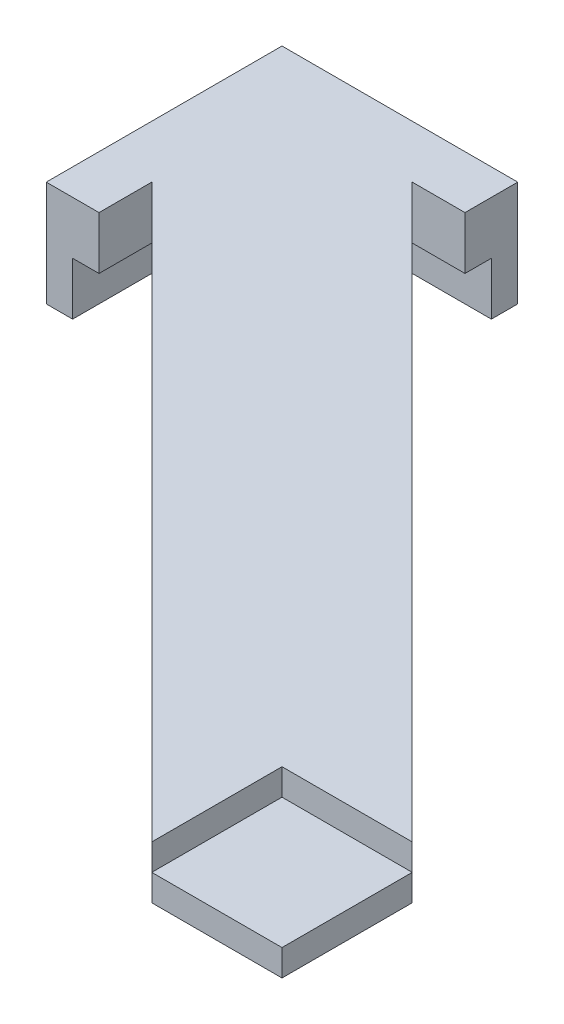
from build123d import *

# Parameters (mm, degrees)
BOSS_EXTRUDE1_DEPTH = 5
SKETCH2_W           = 12.343134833
SKETCH2_H           = 12.343134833
CUT_EXTRUDE1_DEPTH  = 2.5
BOSS_EXTRUDE2_DEPTH = 5


with BuildPart() as part:
    # Sketch1 → Boss-Extrude1 (new body)
    with BuildSketch(Plane(origin=(0, 0, 0), x_dir=(1, 0, 0), z_dir=(0, 1, 0))):
        Polygon((19.843134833, 71.5), (19.843134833, 66.5), (14.843134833, 66.5), (69, 12.343134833), (69, 0), (56.656865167, 0), (2.5, 54.156865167), (2.5, 49.156865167), (-2.5, 49.156865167), (-2.5, 71.5), align=None)
    extrude(amount=BOSS_EXTRUDE1_DEPTH)

    # Sketch2 → Cut-Extrude1 (cut)
    with BuildSketch(Plane(origin=(0, 5, 0), x_dir=(1, 0, 0), z_dir=(0, 1, 0))):
        with Locations((62.828432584, 6.171567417)):
            Rectangle(SKETCH2_W, SKETCH2_H)
    extrude(amount=-CUT_EXTRUDE1_DEPTH, mode=Mode.SUBTRACT)

    # Sketch3 → Boss-Extrude2 (add)
    with BuildSketch(Plane.XZ):
        Polygon((19.843134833, -69), (19.843134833, -71.5), (-2.5, -71.5), (-2.5, -49.156865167), (0, -49.156865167), (0, -69), align=None)
    extrude(amount=BOSS_EXTRUDE2_DEPTH)


solid = part.part
